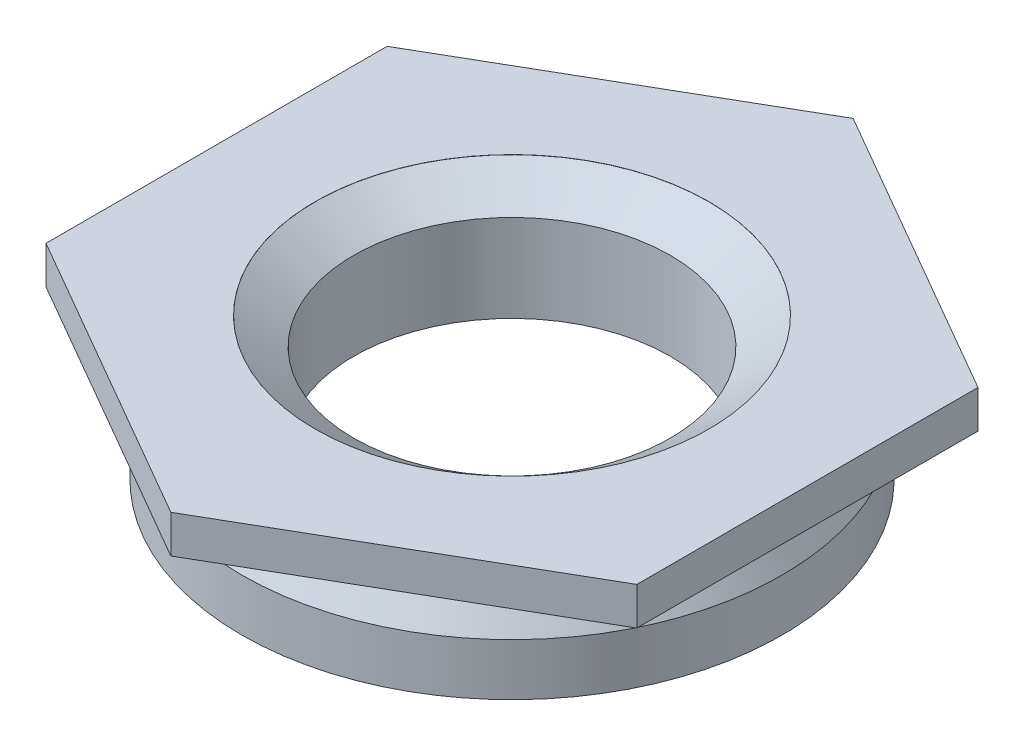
from build123d import *

# Parameters (mm, degrees)
HEXDIESKE_R  = 5.5372
HEXDIE_DEPTH = 0.6096


with BuildPart() as part:
    # BodySke → Body (revolve)
    with BuildSketch(Plane.XY, mode=Mode.PRIVATE) as body_sk:
        Polygon((4.048141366, 0), (5.5118, 0), (5.5118, 0.6096), (2.5527, 0.6096), (2.5527, -1.6764), (4.3561, -1.6764), (4.3561, -0.8382), (4.048141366, -0.3048), align=None)
    revolve(body_sk.sketch.rotate(Axis((0, 0, 0), (0, 1, 0)), 90), axis=Axis((0, 0, 0), (0, 1, 0)))

    # EndChamferSke → EndChamfer (revolve, cut)
    with BuildSketch(Plane.XY, mode=Mode.PRIVATE) as endchamfer_sk:
        Polygon((3.175, -1.9304), (3.175, -1.67386), (2.5527, -1.238282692), (2.5527, -1.9304), align=None)
        Polygon((3.175, 0.60706), (2.5527, 0.171482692), (2.5527, 0.8636), (3.175, 0.8636), align=None)
    revolve(endchamfer_sk.sketch.rotate(Axis((0, -2.54, 0), (0, 1, 0)), 90), axis=Axis((0, -2.54, 0), (0, 1, 0)), mode=Mode.SUBTRACT)

    # HexDieSke → HexDie (cut)
    with BuildSketch(Plane(origin=(0, 0.6096, 0), x_dir=(-1, 0, 0), z_dir=(0, 1, 0))):
        Circle(HEXDIESKE_R)
        Polygon((0, 5.499261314), (4.7625, 2.749630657), (4.7625, -2.749630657), (0, -5.499261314), (-4.7625, -2.749630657), (-4.7625, 2.749630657), align=None, mode=Mode.SUBTRACT)
    extrude(amount=-HEXDIE_DEPTH, mode=Mode.SUBTRACT)


solid = part.part
